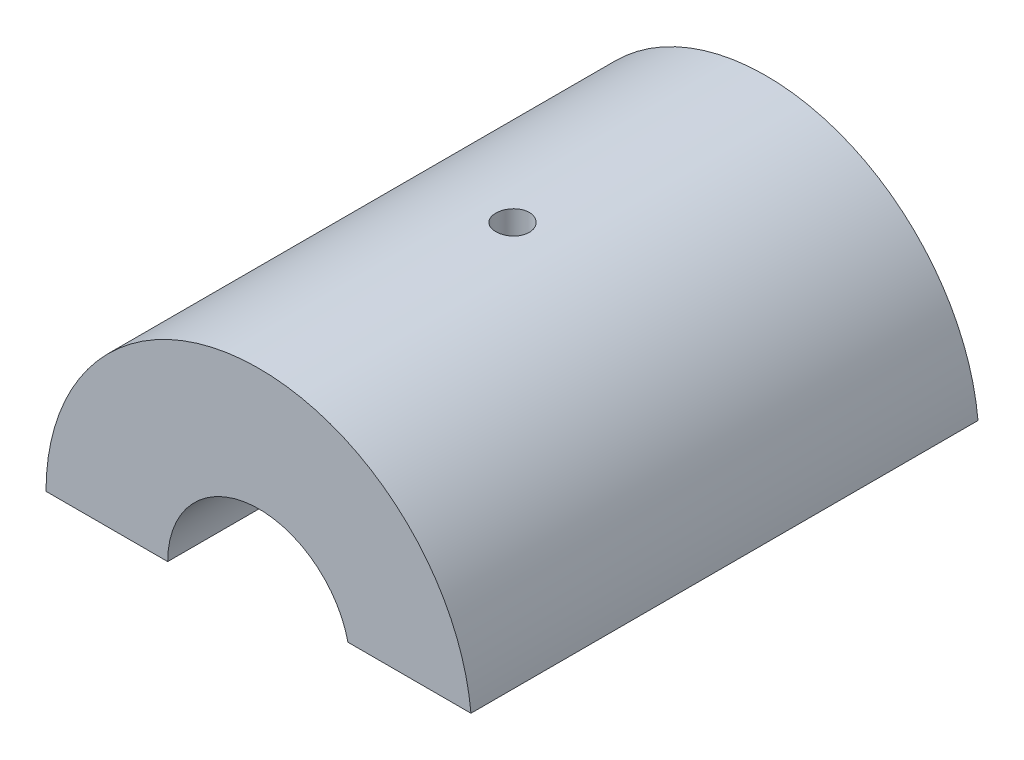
from build123d import *

# Parameters (mm, degrees)
EXTRUSION1_DEPTH        = 50
ESQUISSE2_R             = 4
ENL_V_MAT_EXTRU_1_DEPTH = 17
TROU_TARAUD_M41_D       = 3.3


with BuildPart() as part:
    # Esquisse1 → Extrusion1 (new body)
    with BuildSketch(Plane.XY):
        with BuildLine():
            Line((-9, 0), (-21, 0))
            ThreePointArc((-21, 0), (-1.00113831, 20.976122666), (20.90454496, 2))
            Line((20.90454496, 2), (8.774964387, 2))
            ThreePointArc((8.774964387, 2), (-1.006310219, 8.943564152), (-9, 0))
        make_face()
    extrude(amount=EXTRUSION1_DEPTH)

    # Esquisse2 → Enl_v. mat.-Extru.1 (cut)
    with BuildSketch(Plane.XZ):
        with Locations(Location((0, 25, 0), (0, 0, 270))):
            Circle(ESQUISSE2_R)
    extrude(amount=-ENL_V_MAT_EXTRU_1_DEPTH, mode=Mode.SUBTRACT)

    # Trou taraud_ M41 (through all)
    with Locations(Plane.XZ.offset(-17)):
        with Locations((0, 25)):
            Hole(TROU_TARAUD_M41_D / 2)


solid = part.part
